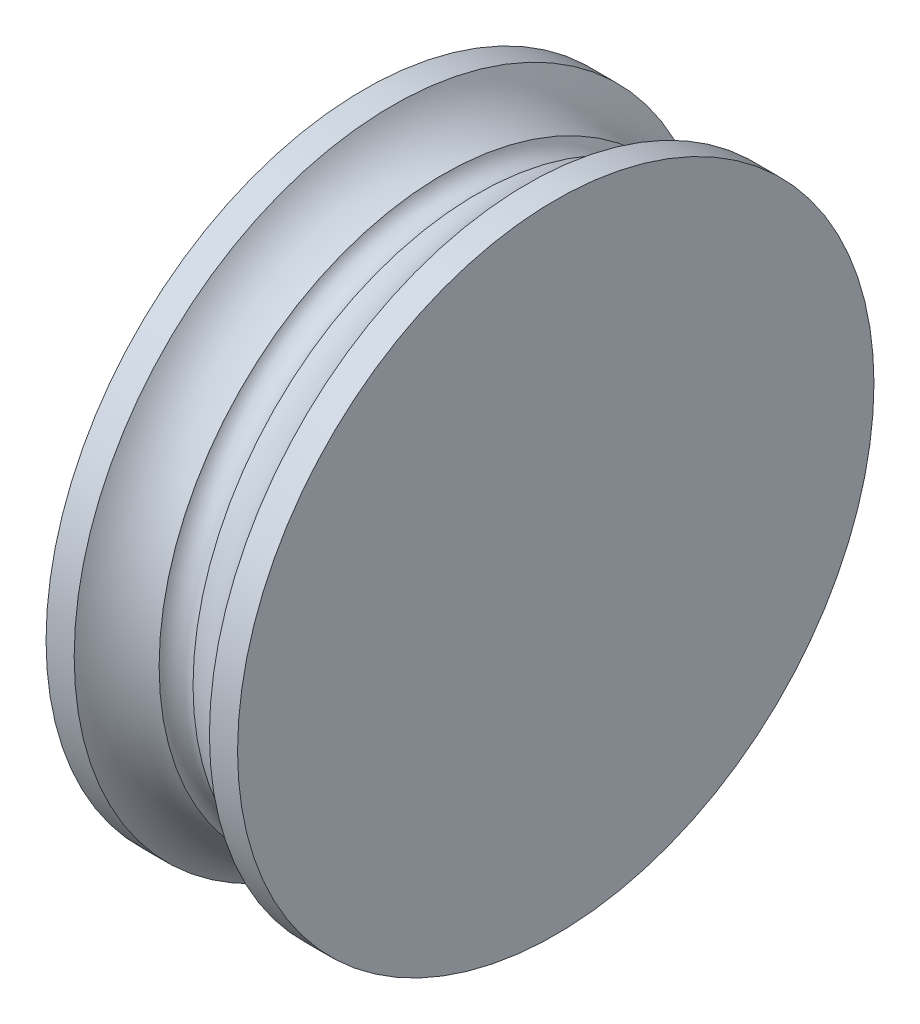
ISO-10303-21;
HEADER;
FILE_DESCRIPTION(('STEP AP214'),'2;1');
FILE_NAME('part.step','',(''),(''),'','','');
FILE_SCHEMA(('AUTOMOTIVE_DESIGN { 1 0 10303 214 1 1 1 1 }'));
ENDSEC;
DATA;
#1=APPLICATION_CONTEXT('core data for automotive mechanical design processes');
#2=APPLICATION_PROTOCOL_DEFINITION('international standard','automotive_design',2000,#1);
#3=PRODUCT_CONTEXT('',#1,'mechanical');
#4=PRODUCT('Part','Part','',(#3));
#5=PRODUCT_RELATED_PRODUCT_CATEGORY('part','',(#4));
#6=PRODUCT_DEFINITION_FORMATION('','',#4);
#7=PRODUCT_DEFINITION_CONTEXT('part definition',#1,'design');
#8=PRODUCT_DEFINITION('design','',#6,#7);
#9=PRODUCT_DEFINITION_SHAPE('','',#8);
#10=(LENGTH_UNIT() NAMED_UNIT(*) SI_UNIT(.MILLI.,.METRE.));
#11=(NAMED_UNIT(*) PLANE_ANGLE_UNIT() SI_UNIT($,.RADIAN.));
#12=(NAMED_UNIT(*) SI_UNIT($,.STERADIAN.) SOLID_ANGLE_UNIT());
#13=UNCERTAINTY_MEASURE_WITH_UNIT(LENGTH_MEASURE(1.E-05),#10,'distance_accuracy_value','');
#14=(GEOMETRIC_REPRESENTATION_CONTEXT(3) GLOBAL_UNCERTAINTY_ASSIGNED_CONTEXT((#13)) GLOBAL_UNIT_ASSIGNED_CONTEXT((#10,
#11,#12)) REPRESENTATION_CONTEXT('',''));
#15=CARTESIAN_POINT('',(0.,0.,0.));
#16=DIRECTION('',(0.,0.,1.));
#17=DIRECTION('',(1.,0.,0.));
#18=AXIS2_PLACEMENT_3D('',#15,#16,#17);
#19=CARTESIAN_POINT('',(-8.955,0.,0.));
#20=DIRECTION('',(1.,0.,0.));
#21=DIRECTION('',(0.,0.,-1.));
#22=AXIS2_PLACEMENT_3D('',#19,#20,#21);
#23=PLANE('',#22);
#24=CARTESIAN_POINT('',(-8.95499999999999,0.,0.));
#25=DIRECTION('',(-1.,0.,0.));
#26=DIRECTION('',(0.,0.,1.));
#27=AXIS2_PLACEMENT_3D('',#24,#25,#26);
#28=CIRCLE('',#27,29.76);
#29=CARTESIAN_POINT('',(-8.95499999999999,0.,29.76));
#30=VERTEX_POINT('',#29);
#31=EDGE_CURVE('E10',#30,#30,#28,.T.);
#32=ORIENTED_EDGE('',*,*,#31,.T.);
#33=EDGE_LOOP('',(#32));
#34=FACE_BOUND('',#33,.T.);
#35=ADVANCED_FACE('F37',(#34),#23,.F.);
#36=CARTESIAN_POINT('',(-8.955,0.,0.));
#37=DIRECTION('',(-1.,0.,0.));
#38=DIRECTION('',(0.,0.,1.));
#39=AXIS2_PLACEMENT_3D('',#36,#37,#38);
#40=CYLINDRICAL_SURFACE('',#39,29.76);
#41=ORIENTED_EDGE('',*,*,#31,.F.);
#42=EDGE_LOOP('',(#41));
#43=FACE_BOUND('',#42,.T.);
#44=CARTESIAN_POINT('',(-6.325,0.,0.));
#45=DIRECTION('',(-1.,0.,0.));
#46=DIRECTION('',(0.,0.,1.));
#47=AXIS2_PLACEMENT_3D('',#44,#45,#46);
#48=CIRCLE('',#47,29.76);
#49=CARTESIAN_POINT('',(-6.325,0.,29.76));
#50=VERTEX_POINT('',#49);
#51=EDGE_CURVE('E43',#50,#50,#48,.T.);
#52=ORIENTED_EDGE('',*,*,#51,.T.);
#53=EDGE_LOOP('',(#52));
#54=FACE_BOUND('',#53,.T.);
#55=ADVANCED_FACE('F75',(#43,#54),#40,.T.);
#56=CARTESIAN_POINT('',(-0.545231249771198,0.,0.));
#57=DIRECTION('',(-1.,0.,0.));
#58=DIRECTION('',(0.,0.,1.));
#59=AXIS2_PLACEMENT_3D('',#56,#57,#58);
#60=TOROIDAL_SURFACE('',#59,33.201686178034,6.72688119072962);
#61=ORIENTED_EDGE('',*,*,#51,.F.);
#62=EDGE_LOOP('',(#61));
#63=FACE_BOUND('',#62,.T.);
#64=CARTESIAN_POINT('',(-1.585,0.,0.));
#65=DIRECTION('',(-1.,0.,0.));
#66=DIRECTION('',(0.,0.,1.));
#67=AXIS2_PLACEMENT_3D('',#64,#65,#66);
#68=CIRCLE('',#67,26.5556489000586);
#69=CARTESIAN_POINT('',(-1.585,0.,26.5556489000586));
#70=VERTEX_POINT('',#69);
#71=EDGE_CURVE('E47',#70,#70,#68,.T.);
#72=ORIENTED_EDGE('',*,*,#71,.T.);
#73=EDGE_LOOP('',(#72));
#74=FACE_BOUND('',#73,.T.);
#75=ADVANCED_FACE('F79',(#63,#74),#60,.F.);
#76=CARTESIAN_POINT('',(0.,0.,0.));
#77=DIRECTION('',(-1.,0.,0.));
#78=DIRECTION('',(0.,0.,1.));
#79=AXIS2_PLACEMENT_3D('',#76,#77,#78);
#80=TOROIDAL_SURFACE('',#79,27.3414519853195,1.76909906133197);
#81=ORIENTED_EDGE('',*,*,#71,.F.);
#82=EDGE_LOOP('',(#81));
#83=FACE_BOUND('',#82,.T.);
#84=CARTESIAN_POINT('',(1.585,0.,0.));
#85=DIRECTION('',(-1.,0.,0.));
#86=DIRECTION('',(0.,0.,1.));
#87=AXIS2_PLACEMENT_3D('',#84,#85,#86);
#88=CIRCLE('',#87,26.5556489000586);
#89=CARTESIAN_POINT('',(1.585,0.,26.5556489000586));
#90=VERTEX_POINT('',#89);
#91=EDGE_CURVE('E51',#90,#90,#88,.T.);
#92=ORIENTED_EDGE('',*,*,#91,.T.);
#93=EDGE_LOOP('',(#92));
#94=FACE_BOUND('',#93,.T.);
#95=ADVANCED_FACE('F84',(#83,#94),#80,.F.);
#96=CARTESIAN_POINT('',(0.545231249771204,0.,0.));
#97=DIRECTION('',(-1.,0.,0.));
#98=DIRECTION('',(0.,0.,1.));
#99=AXIS2_PLACEMENT_3D('',#96,#97,#98);
#100=TOROIDAL_SURFACE('',#99,33.201686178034,6.72688119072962);
#101=ORIENTED_EDGE('',*,*,#91,.F.);
#102=EDGE_LOOP('',(#101));
#103=FACE_BOUND('',#102,.T.);
#104=CARTESIAN_POINT('',(6.325,0.,0.));
#105=DIRECTION('',(-1.,0.,0.));
#106=DIRECTION('',(0.,0.,1.));
#107=AXIS2_PLACEMENT_3D('',#104,#105,#106);
#108=CIRCLE('',#107,29.76);
#109=CARTESIAN_POINT('',(6.325,0.,29.76));
#110=VERTEX_POINT('',#109);
#111=EDGE_CURVE('E56',#110,#110,#108,.T.);
#112=ORIENTED_EDGE('',*,*,#111,.T.);
#113=EDGE_LOOP('',(#112));
#114=FACE_BOUND('',#113,.T.);
#115=ADVANCED_FACE('F71',(#103,#114),#100,.F.);
#116=CARTESIAN_POINT('',(-8.955,0.,0.));
#117=DIRECTION('',(-1.,0.,0.));
#118=DIRECTION('',(0.,0.,1.));
#119=AXIS2_PLACEMENT_3D('',#116,#117,#118);
#120=CYLINDRICAL_SURFACE('',#119,29.76);
#121=ORIENTED_EDGE('',*,*,#111,.F.);
#122=EDGE_LOOP('',(#121));
#123=FACE_BOUND('',#122,.T.);
#124=CARTESIAN_POINT('',(8.955,0.,0.));
#125=DIRECTION('',(-1.,0.,0.));
#126=DIRECTION('',(0.,0.,1.));
#127=AXIS2_PLACEMENT_3D('',#124,#125,#126);
#128=CIRCLE('',#127,29.76);
#129=CARTESIAN_POINT('',(8.955,0.,29.76));
#130=VERTEX_POINT('',#129);
#131=EDGE_CURVE('E59',#130,#130,#128,.T.);
#132=ORIENTED_EDGE('',*,*,#131,.T.);
#133=EDGE_LOOP('',(#132));
#134=FACE_BOUND('',#133,.T.);
#135=ADVANCED_FACE('F63',(#123,#134),#120,.T.);
#136=CARTESIAN_POINT('',(8.955,0.,0.));
#137=DIRECTION('',(-1.,0.,0.));
#138=DIRECTION('',(0.,0.,1.));
#139=AXIS2_PLACEMENT_3D('',#136,#137,#138);
#140=PLANE('',#139);
#141=ORIENTED_EDGE('',*,*,#131,.F.);
#142=EDGE_LOOP('',(#141));
#143=FACE_BOUND('',#142,.T.);
#144=ADVANCED_FACE('F65',(#143),#140,.F.);
#145=CLOSED_SHELL('',(#35,#55,#75,#95,#115,#135,#144));
#146=MANIFOLD_SOLID_BREP('B2',#145);
#147=ADVANCED_BREP_SHAPE_REPRESENTATION('',(#18,#146),#14);
#148=SHAPE_DEFINITION_REPRESENTATION(#9,#147);
ENDSEC;
END-ISO-10303-21;
